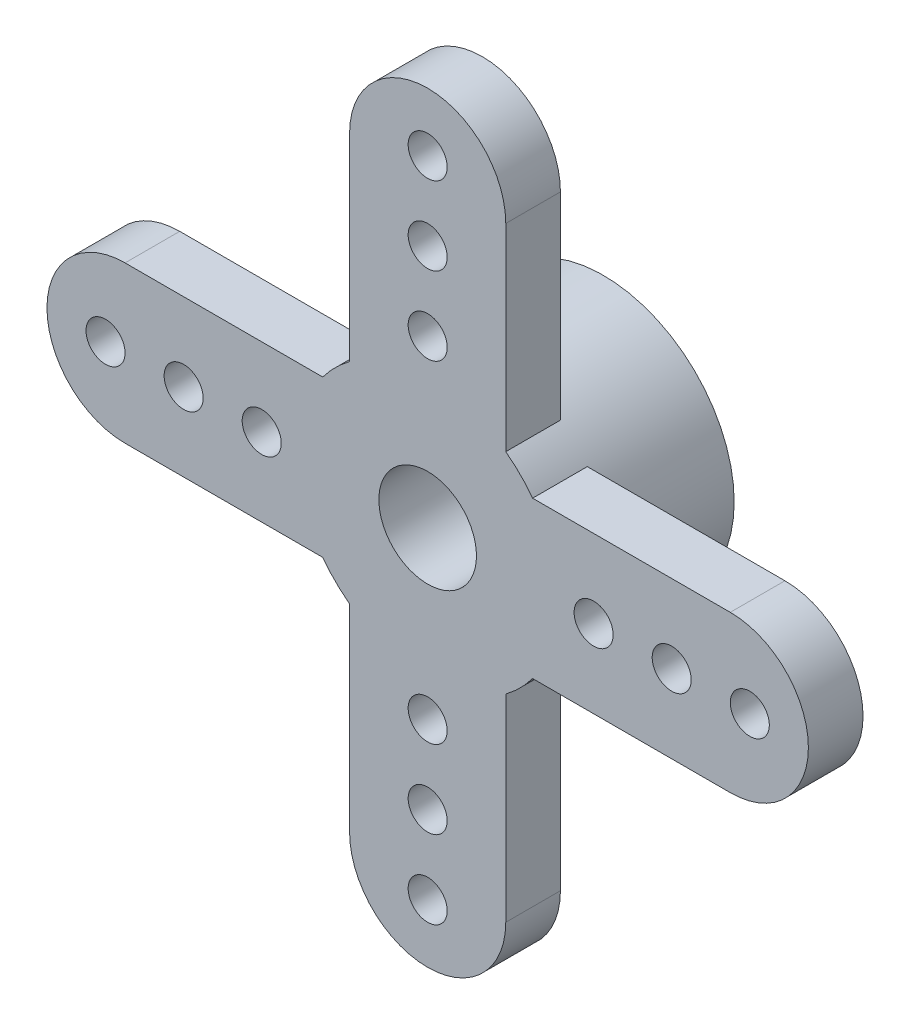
from build123d import *

# Parameters (mm, degrees)
SKIZZE1_R                       = 3.35
SKIZZE1_R_2                     = 2.5
AUFSATZ_LINEAR_AUSTRAGEN1_DEPTH = 4.5
AUFSATZ_LINEAR_START            = -2
SKIZZE2_R                       = 3.35
AUFSATZ_LINEAR_AUSTRAGEN2_DEPTH = 2
SCHNITT_LINEAR_AUSTRAGEN1_REACH = 8.534
SKIZZE3_R                       = 1.25
SKIZZE4_R                       = 0.5
AUFSATZ_LINEAR_AUSTRAGEN4_DEPTH = 1.4


with BuildPart() as part:
    # Skizze1 → Aufsatz-Linear austragen1 (new body)
    with BuildSketch(Plane.XY):
        Circle(SKIZZE1_R)
        Circle(SKIZZE1_R_2, mode=Mode.SUBTRACT)
    extrude(amount=AUFSATZ_LINEAR_AUSTRAGEN1_DEPTH)

    # Skizze2 → Aufsatz-Linear austragen2 (add)
    with BuildSketch(Plane.XY.offset(4.5).offset(AUFSATZ_LINEAR_START)):
        Circle(SKIZZE2_R)
    extrude(amount=AUFSATZ_LINEAR_AUSTRAGEN2_DEPTH)

    # Skizze3 → Schnitt-Linear austragen1 (cut, up to next)
    with BuildSketch(Plane.XY.offset(4.5), mode=Mode.PRIVATE) as schnitt_linear_austragen1_sk1:
        Circle(SKIZZE3_R)
    schnitt_linear_austragen1_tool1 = extrude(schnitt_linear_austragen1_sk1.sketch, amount=-SCHNITT_LINEAR_AUSTRAGEN1_REACH, mode=Mode.PRIVATE) & part.part
    add(schnitt_linear_austragen1_tool1.solids().sort_by_distance((0, 0, 4.5))[0], mode=Mode.SUBTRACT)

    # Skizze4 → Aufsatz-Linear austragen4 (add)
    # profile 1 of 4: a face of its own
    with BuildSketch(Plane.XY.offset(4.5)):
        with BuildLine():
            Line((2, -2), (-2, -2))
            Line((-2, -2), (-2, -7.75))
            ThreePointArc((-2, -7.75), (0, -9.75), (2, -7.75))
            Line((2, -7.75), (2, -2))
        make_face()
        with Locations((0, -8.25)):
            Circle(SKIZZE4_R, mode=Mode.SUBTRACT)
        with Locations((0, -6.25)):
            Circle(SKIZZE4_R, mode=Mode.SUBTRACT)
        with Locations((0, -4.25)):
            Circle(SKIZZE4_R, mode=Mode.SUBTRACT)
    # profile 2 of 4: a face of its own
    with BuildSketch(Plane.XY.offset(4.5)):
        with BuildLine():
            Line((-2, -2), (-2, 2))
            Line((-2, 2), (-7.75, 2))
            ThreePointArc((-7.75, 2), (-9.75, 0), (-7.75, -2))
            Line((-7.75, -2), (-2, -2))
        make_face()
        with Locations((-8.25, 0)):
            Circle(SKIZZE4_R, mode=Mode.SUBTRACT)
        with Locations((-6.25, 0)):
            Circle(SKIZZE4_R, mode=Mode.SUBTRACT)
        with Locations((-4.25, 0)):
            Circle(SKIZZE4_R, mode=Mode.SUBTRACT)
    # profile 3 of 4: a face of its own
    with BuildSketch(Plane.XY.offset(4.5)):
        with BuildLine():
            Line((2, 2), (2, -2))
            Line((2, -2), (7.75, -2))
            ThreePointArc((7.75, -2), (9.75, 0), (7.75, 2))
            Line((7.75, 2), (2, 2))
        make_face()
        with Locations((4.25, 0)):
            Circle(SKIZZE4_R, mode=Mode.SUBTRACT)
        with Locations((6.25, 0)):
            Circle(SKIZZE4_R, mode=Mode.SUBTRACT)
        with Locations((8.25, 0)):
            Circle(SKIZZE4_R, mode=Mode.SUBTRACT)
    # profile 4 of 4: a face of its own
    with BuildSketch(Plane.XY.offset(4.5)):
        with BuildLine():
            Line((-2, 7.75), (-2, 2))
            Line((-2, 2), (2, 2))
            Line((2, 2), (2, 7.75))
            ThreePointArc((2, 7.75), (0, 9.75), (-2, 7.75))
        make_face()
        with Locations((0, 4.25)):
            Circle(SKIZZE4_R, mode=Mode.SUBTRACT)
        with Locations((0, 6.25)):
            Circle(SKIZZE4_R, mode=Mode.SUBTRACT)
        with Locations((0, 8.25)):
            Circle(SKIZZE4_R, mode=Mode.SUBTRACT)
    extrude(amount=-AUFSATZ_LINEAR_AUSTRAGEN4_DEPTH)


solid = part.part
